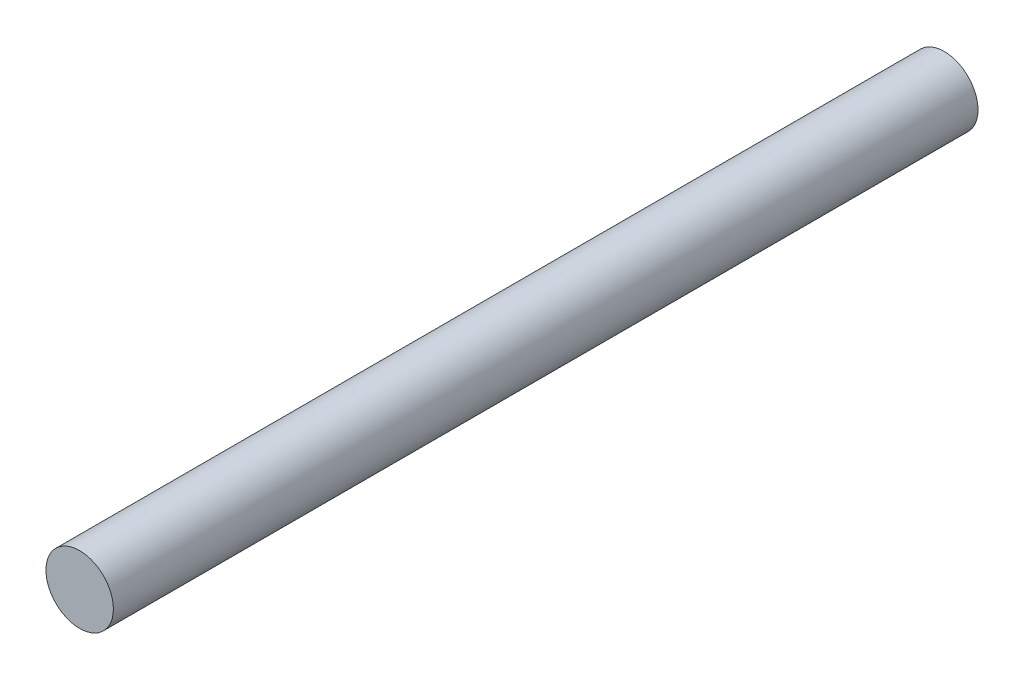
from build123d import *

# Parameters (mm, degrees)
AUFSATZ_LIN_GK_START = -500
PROFIL_R             = 39
AUFSATZ_LIN_GK_DEPTH = 1000


with BuildPart() as part:
    # Profil → Aufsatz-Lin_GK (new body)
    with BuildSketch(Plane.XY.offset(AUFSATZ_LIN_GK_START)):
        Circle(PROFIL_R)
    extrude(amount=AUFSATZ_LIN_GK_DEPTH)


solid = part.part
